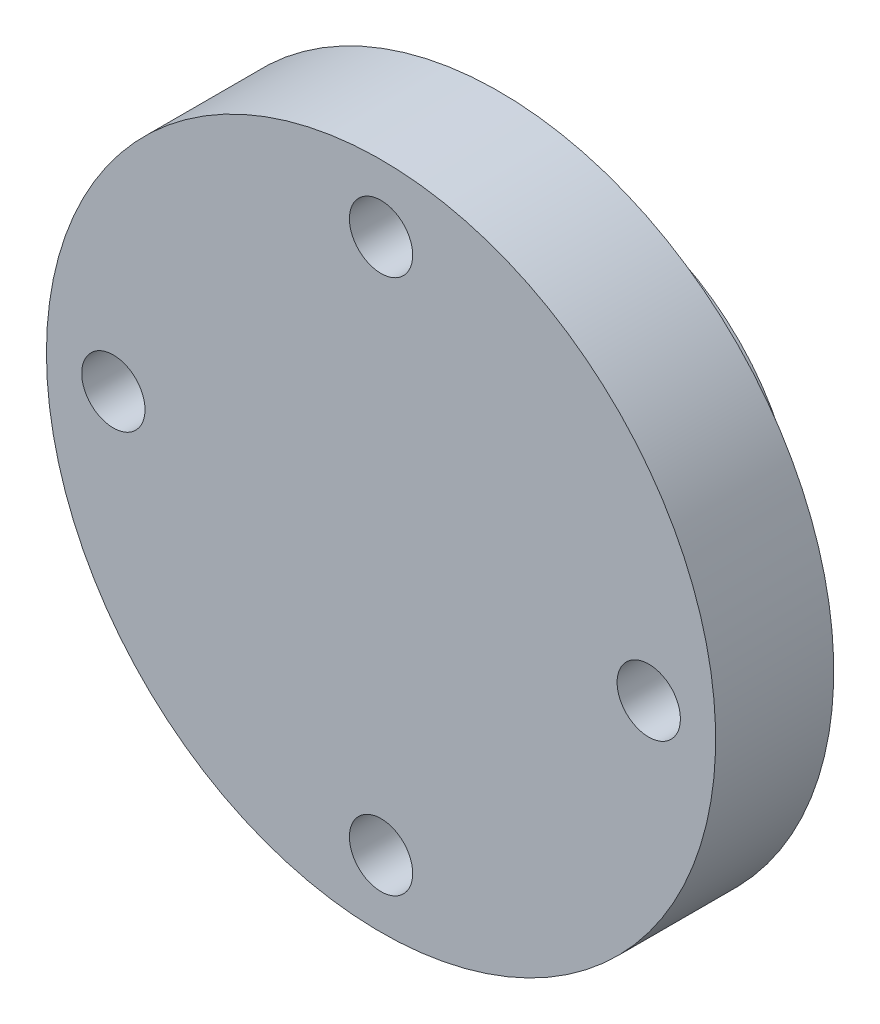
from build123d import *

# Parameters (mm, degrees)
SKETCH1_R              = 26.9875
BOSS_EXTRUDE1_DEPTH    = 9.525
SKETCH3_R              = 16.5227
BOSS_EXTRUDE2_DEPTH    = 7.62
SKETCH4_W              = 1.3462
SKETCH4_H              = 2.6162
F_10_CLEARANCE_HOLE1_D = 5.1054


with BuildPart() as part:
    # Sketch1 → Boss-Extrude1 (new body)
    with BuildSketch(Plane.XY):
        with Locations(Location((0, 0, 0), (0, 0, 180))):
            Circle(SKETCH1_R)
    extrude(amount=BOSS_EXTRUDE1_DEPTH)

    # Sketch3 → Boss-Extrude2 (add)
    with BuildSketch(Plane(origin=(0, 0, 0), x_dir=(-1, 0, 0), z_dir=(0, 0, -1))):
        with Locations(Location((0, 0, 0), (0, 0, 180))):
            Circle(SKETCH3_R)
    extrude(amount=BOSS_EXTRUDE2_DEPTH)

    # Sketch4 → Cut-Revolve3 (revolve, cut)
    with BuildSketch(Plane(origin=(0, 0, 0), x_dir=(1, 0, 0), z_dir=(0, 1, 0)), mode=Mode.PRIVATE) as cut_revolve3_sk:
        with Locations((-15.8496, 3.7719)):
            Rectangle(SKETCH4_W, SKETCH4_H)
    revolve(cut_revolve3_sk.sketch.rotate(Axis((0, 0, -8.47725), (0, 0, 1)), 180), axis=Axis((0, 0, -8.47725), (0, 0, 1)), mode=Mode.SUBTRACT)

    # 10 Clearance Hole1 (through all)
    with Locations(Plane.XY.offset(9.525)):
        with Locations((0, -21.59), (21.59, 0), (0, 21.59), (-21.59, 0)):
            Hole(F_10_CLEARANCE_HOLE1_D / 2)


solid = part.part
